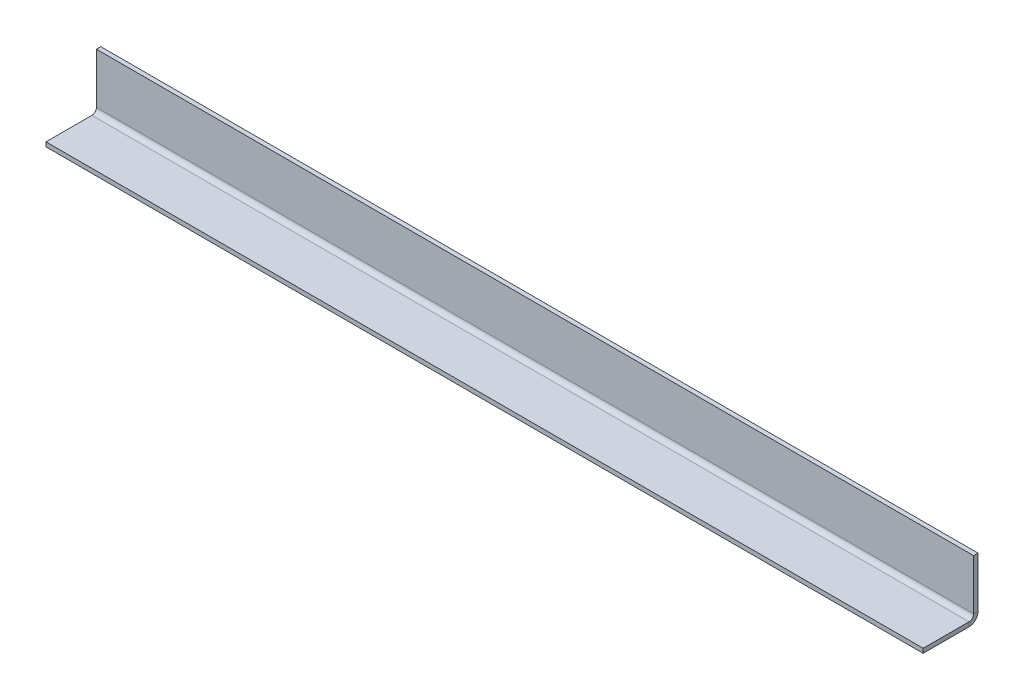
ISO-10303-21;
HEADER;
FILE_DESCRIPTION(('STEP AP214'),'2;1');
FILE_NAME('part.step','',(''),(''),'','','');
FILE_SCHEMA(('AUTOMOTIVE_DESIGN { 1 0 10303 214 1 1 1 1 }'));
ENDSEC;
DATA;
#1=APPLICATION_CONTEXT('core data for automotive mechanical design processes');
#2=APPLICATION_PROTOCOL_DEFINITION('international standard','automotive_design',2000,#1);
#3=PRODUCT_CONTEXT('',#1,'mechanical');
#4=PRODUCT('Part','Part','',(#3));
#5=PRODUCT_RELATED_PRODUCT_CATEGORY('part','',(#4));
#6=PRODUCT_DEFINITION_FORMATION('','',#4);
#7=PRODUCT_DEFINITION_CONTEXT('part definition',#1,'design');
#8=PRODUCT_DEFINITION('design','',#6,#7);
#9=PRODUCT_DEFINITION_SHAPE('','',#8);
#10=(LENGTH_UNIT() NAMED_UNIT(*) SI_UNIT(.MILLI.,.METRE.));
#11=(NAMED_UNIT(*) PLANE_ANGLE_UNIT() SI_UNIT($,.RADIAN.));
#12=(NAMED_UNIT(*) SI_UNIT($,.STERADIAN.) SOLID_ANGLE_UNIT());
#13=UNCERTAINTY_MEASURE_WITH_UNIT(LENGTH_MEASURE(1.E-05),#10,'distance_accuracy_value','');
#14=(GEOMETRIC_REPRESENTATION_CONTEXT(3) GLOBAL_UNCERTAINTY_ASSIGNED_CONTEXT((#13)) GLOBAL_UNIT_ASSIGNED_CONTEXT((#10,
#11,#12)) REPRESENTATION_CONTEXT('',''));
#15=CARTESIAN_POINT('',(0.,0.,0.));
#16=DIRECTION('',(0.,0.,1.));
#17=DIRECTION('',(1.,0.,0.));
#18=AXIS2_PLACEMENT_3D('',#15,#16,#17);
#19=CARTESIAN_POINT('',(0.,6.223,0.));
#20=DIRECTION('',(-1.,0.,0.));
#21=DIRECTION('',(0.,0.,1.));
#22=AXIS2_PLACEMENT_3D('',#19,#20,#21);
#23=PLANE('',#22);
#24=DIRECTION('',(0.,0.,1.));
#25=VECTOR('',#24,1.);
#26=CARTESIAN_POINT('',(0.,6.223,0.));
#27=LINE('',#26,#25);
#28=CARTESIAN_POINT('',(0.,6.223,0.));
#29=VERTEX_POINT('',#28);
#30=CARTESIAN_POINT('',(0.,6.223,3.048));
#31=VERTEX_POINT('',#30);
#32=EDGE_CURVE('E11',#29,#31,#27,.T.);
#33=ORIENTED_EDGE('',*,*,#32,.F.);
#34=CARTESIAN_POINT('',(0.,6.223,6.223));
#35=DIRECTION('',(1.,0.,0.));
#36=DIRECTION('',(0.,0.,-1.));
#37=AXIS2_PLACEMENT_3D('',#34,#35,#36);
#38=CIRCLE('',#37,6.223);
#39=CARTESIAN_POINT('',(0.,0.,6.223));
#40=VERTEX_POINT('',#39);
#41=EDGE_CURVE('E186',#29,#40,#38,.F.);
#42=ORIENTED_EDGE('',*,*,#41,.T.);
#43=DIRECTION('',(0.,-1.,0.));
#44=VECTOR('',#43,1.);
#45=CARTESIAN_POINT('',(0.,3.048,6.223));
#46=LINE('',#45,#44);
#47=CARTESIAN_POINT('',(0.,3.048,6.223));
#48=VERTEX_POINT('',#47);
#49=EDGE_CURVE('E56',#48,#40,#46,.T.);
#50=ORIENTED_EDGE('',*,*,#49,.F.);
#51=CARTESIAN_POINT('',(0.,6.223,6.223));
#52=DIRECTION('',(1.,0.,0.));
#53=DIRECTION('',(0.,0.,-1.));
#54=AXIS2_PLACEMENT_3D('',#51,#52,#53);
#55=CIRCLE('',#54,3.175);
#56=EDGE_CURVE('E201',#31,#48,#55,.F.);
#57=ORIENTED_EDGE('',*,*,#56,.F.);
#58=EDGE_LOOP('',(#33,#42,#50,#57));
#59=FACE_BOUND('',#58,.T.);
#60=ADVANCED_FACE('F48',(#59),#23,.T.);
#61=CARTESIAN_POINT('',(0.,3.048,6.223));
#62=DIRECTION('',(-1.,0.,0.));
#63=DIRECTION('',(0.,0.,1.));
#64=AXIS2_PLACEMENT_3D('',#61,#62,#63);
#65=PLANE('',#64);
#66=DIRECTION('',(0.,-1.,0.));
#67=VECTOR('',#66,1.);
#68=CARTESIAN_POINT('',(0.,0.,0.));
#69=LINE('',#68,#67);
#70=CARTESIAN_POINT('',(0.,41.275,0.));
#71=VERTEX_POINT('',#70);
#72=EDGE_CURVE('E189',#71,#29,#69,.T.);
#73=ORIENTED_EDGE('',*,*,#72,.T.);
#74=ORIENTED_EDGE('',*,*,#32,.T.);
#75=DIRECTION('',(0.,1.,0.));
#76=VECTOR('',#75,1.);
#77=CARTESIAN_POINT('',(0.,0.,3.048));
#78=LINE('',#77,#76);
#79=CARTESIAN_POINT('',(0.,41.275,3.048));
#80=VERTEX_POINT('',#79);
#81=EDGE_CURVE('E197',#80,#31,#78,.F.);
#82=ORIENTED_EDGE('',*,*,#81,.F.);
#83=DIRECTION('',(0.,0.,-1.));
#84=VECTOR('',#83,1.);
#85=CARTESIAN_POINT('',(0.,41.275,3.048));
#86=LINE('',#85,#84);
#87=EDGE_CURVE('E193',#80,#71,#86,.T.);
#88=ORIENTED_EDGE('',*,*,#87,.T.);
#89=EDGE_LOOP('',(#73,#74,#82,#88));
#90=FACE_BOUND('',#89,.T.);
#91=ADVANCED_FACE('F228',(#90),#65,.T.);
#92=CARTESIAN_POINT('',(665.771484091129,3.048,0.));
#93=DIRECTION('',(0.,-1.,0.));
#94=DIRECTION('',(0.,0.,-1.));
#95=AXIS2_PLACEMENT_3D('',#92,#93,#94);
#96=PLANE('',#95);
#97=DIRECTION('',(0.,0.,-1.));
#98=VECTOR('',#97,1.);
#99=CARTESIAN_POINT('',(609.6,3.048,0.));
#100=LINE('',#99,#98);
#101=CARTESIAN_POINT('',(609.6,3.048,6.223));
#102=VERTEX_POINT('',#101);
#103=CARTESIAN_POINT('',(609.6,3.04799999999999,38.1));
#104=VERTEX_POINT('',#103);
#105=EDGE_CURVE('E123',#102,#104,#100,.F.);
#106=ORIENTED_EDGE('',*,*,#105,.F.);
#107=DIRECTION('',(-1.,0.,0.));
#108=VECTOR('',#107,1.);
#109=CARTESIAN_POINT('',(665.771484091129,3.048,6.223));
#110=LINE('',#109,#108);
#111=EDGE_CURVE('E205',#102,#48,#110,.T.);
#112=ORIENTED_EDGE('',*,*,#111,.T.);
#113=DIRECTION('',(0.,0.,1.));
#114=VECTOR('',#113,1.);
#115=CARTESIAN_POINT('',(0.,3.048,0.));
#116=LINE('',#115,#114);
#117=CARTESIAN_POINT('',(0.,3.04799999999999,38.1));
#118=VERTEX_POINT('',#117);
#119=EDGE_CURVE('E168',#48,#118,#116,.T.);
#120=ORIENTED_EDGE('',*,*,#119,.T.);
#121=DIRECTION('',(-1.,0.,0.));
#122=VECTOR('',#121,1.);
#123=CARTESIAN_POINT('',(665.771484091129,3.04799999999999,38.1));
#124=LINE('',#123,#122);
#125=EDGE_CURVE('E154',#104,#118,#124,.T.);
#126=ORIENTED_EDGE('',*,*,#125,.F.);
#127=EDGE_LOOP('',(#106,#112,#120,#126));
#128=FACE_BOUND('',#127,.T.);
#129=ADVANCED_FACE('F270',(#128),#96,.F.);
#130=CARTESIAN_POINT('',(665.771484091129,0.,38.1));
#131=DIRECTION('',(0.,0.,1.));
#132=DIRECTION('',(1.,0.,0.));
#133=AXIS2_PLACEMENT_3D('',#130,#131,#132);
#134=PLANE('',#133);
#135=DIRECTION('',(-1.,0.,0.));
#136=VECTOR('',#135,1.);
#137=CARTESIAN_POINT('',(665.771484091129,0.,38.1));
#138=LINE('',#137,#136);
#139=CARTESIAN_POINT('',(609.6,0.,38.1));
#140=VERTEX_POINT('',#139);
#141=CARTESIAN_POINT('',(0.,0.,38.1));
#142=VERTEX_POINT('',#141);
#143=EDGE_CURVE('E149',#140,#142,#138,.T.);
#144=ORIENTED_EDGE('',*,*,#143,.F.);
#145=DIRECTION('',(0.,-1.,0.));
#146=VECTOR('',#145,1.);
#147=CARTESIAN_POINT('',(609.6,0.,38.1));
#148=LINE('',#147,#146);
#149=EDGE_CURVE('E122',#140,#104,#148,.F.);
#150=ORIENTED_EDGE('',*,*,#149,.T.);
#151=ORIENTED_EDGE('',*,*,#125,.T.);
#152=DIRECTION('',(0.,1.,0.));
#153=VECTOR('',#152,1.);
#154=CARTESIAN_POINT('',(0.,0.,38.1));
#155=LINE('',#154,#153);
#156=EDGE_CURVE('E170',#142,#118,#155,.T.);
#157=ORIENTED_EDGE('',*,*,#156,.F.);
#158=EDGE_LOOP('',(#144,#150,#151,#157));
#159=FACE_BOUND('',#158,.T.);
#160=ADVANCED_FACE('F274',(#159),#134,.T.);
#161=CARTESIAN_POINT('',(665.771484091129,0.,0.));
#162=DIRECTION('',(0.,-1.,0.));
#163=DIRECTION('',(0.,0.,-1.));
#164=AXIS2_PLACEMENT_3D('',#161,#162,#163);
#165=PLANE('',#164);
#166=DIRECTION('',(-1.,0.,0.));
#167=VECTOR('',#166,1.);
#168=CARTESIAN_POINT('',(665.771484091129,0.,6.223));
#169=LINE('',#168,#167);
#170=CARTESIAN_POINT('',(609.6,0.,6.223));
#171=VERTEX_POINT('',#170);
#172=EDGE_CURVE('E139',#171,#40,#169,.T.);
#173=ORIENTED_EDGE('',*,*,#172,.F.);
#174=DIRECTION('',(0.,0.,1.));
#175=VECTOR('',#174,1.);
#176=CARTESIAN_POINT('',(609.6,0.,0.));
#177=LINE('',#176,#175);
#178=EDGE_CURVE('E126',#171,#140,#177,.T.);
#179=ORIENTED_EDGE('',*,*,#178,.T.);
#180=ORIENTED_EDGE('',*,*,#143,.T.);
#181=DIRECTION('',(0.,0.,1.));
#182=VECTOR('',#181,1.);
#183=CARTESIAN_POINT('',(0.,0.,0.));
#184=LINE('',#183,#182);
#185=EDGE_CURVE('E147',#40,#142,#184,.T.);
#186=ORIENTED_EDGE('',*,*,#185,.F.);
#187=EDGE_LOOP('',(#173,#179,#180,#186));
#188=FACE_BOUND('',#187,.T.);
#189=ADVANCED_FACE('F145',(#188),#165,.T.);
#190=CARTESIAN_POINT('',(665.771484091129,6.223,6.223));
#191=DIRECTION('',(-1.,0.,0.));
#192=DIRECTION('',(0.,0.,1.));
#193=AXIS2_PLACEMENT_3D('',#190,#191,#192);
#194=CYLINDRICAL_SURFACE('',#193,6.223);
#195=DIRECTION('',(-1.,0.,0.));
#196=VECTOR('',#195,1.);
#197=CARTESIAN_POINT('',(665.771484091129,6.223,0.));
#198=LINE('',#197,#196);
#199=CARTESIAN_POINT('',(609.6,6.223,0.));
#200=VERTEX_POINT('',#199);
#201=EDGE_CURVE('E142',#200,#29,#198,.T.);
#202=ORIENTED_EDGE('',*,*,#201,.F.);
#203=CARTESIAN_POINT('',(609.6,6.223,6.223));
#204=DIRECTION('',(-1.,0.,0.));
#205=DIRECTION('',(0.,0.,1.));
#206=AXIS2_PLACEMENT_3D('',#203,#204,#205);
#207=CIRCLE('',#206,6.223);
#208=EDGE_CURVE('E116',#171,#200,#207,.F.);
#209=ORIENTED_EDGE('',*,*,#208,.F.);
#210=ORIENTED_EDGE('',*,*,#172,.T.);
#211=ORIENTED_EDGE('',*,*,#41,.F.);
#212=EDGE_LOOP('',(#202,#209,#210,#211));
#213=FACE_BOUND('',#212,.T.);
#214=ADVANCED_FACE('F137',(#213),#194,.T.);
#215=CARTESIAN_POINT('',(665.771484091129,0.,0.));
#216=DIRECTION('',(0.,0.,-1.));
#217=DIRECTION('',(-1.,0.,0.));
#218=AXIS2_PLACEMENT_3D('',#215,#216,#217);
#219=PLANE('',#218);
#220=DIRECTION('',(-1.,0.,0.));
#221=VECTOR('',#220,1.);
#222=CARTESIAN_POINT('',(665.771484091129,41.275,0.));
#223=LINE('',#222,#221);
#224=CARTESIAN_POINT('',(609.6,41.275,0.));
#225=VERTEX_POINT('',#224);
#226=EDGE_CURVE('E156',#225,#71,#223,.T.);
#227=ORIENTED_EDGE('',*,*,#226,.F.);
#228=DIRECTION('',(0.,1.,0.));
#229=VECTOR('',#228,1.);
#230=CARTESIAN_POINT('',(609.6,0.,0.));
#231=LINE('',#230,#229);
#232=EDGE_CURVE('E243',#225,#200,#231,.F.);
#233=ORIENTED_EDGE('',*,*,#232,.T.);
#234=ORIENTED_EDGE('',*,*,#201,.T.);
#235=ORIENTED_EDGE('',*,*,#72,.F.);
#236=EDGE_LOOP('',(#227,#233,#234,#235));
#237=FACE_BOUND('',#236,.T.);
#238=ADVANCED_FACE('F225',(#237),#219,.T.);
#239=CARTESIAN_POINT('',(665.771484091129,41.275,3.048));
#240=DIRECTION('',(0.,1.,0.));
#241=DIRECTION('',(0.,0.,1.));
#242=AXIS2_PLACEMENT_3D('',#239,#240,#241);
#243=PLANE('',#242);
#244=DIRECTION('',(-1.,0.,0.));
#245=VECTOR('',#244,1.);
#246=CARTESIAN_POINT('',(665.771484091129,41.275,3.048));
#247=LINE('',#246,#245);
#248=CARTESIAN_POINT('',(609.6,41.275,3.048));
#249=VERTEX_POINT('',#248);
#250=EDGE_CURVE('E212',#249,#80,#247,.T.);
#251=ORIENTED_EDGE('',*,*,#250,.F.);
#252=DIRECTION('',(0.,0.,1.));
#253=VECTOR('',#252,1.);
#254=CARTESIAN_POINT('',(609.6,41.275,3.048));
#255=LINE('',#254,#253);
#256=EDGE_CURVE('E180',#249,#225,#255,.F.);
#257=ORIENTED_EDGE('',*,*,#256,.T.);
#258=ORIENTED_EDGE('',*,*,#226,.T.);
#259=ORIENTED_EDGE('',*,*,#87,.F.);
#260=EDGE_LOOP('',(#251,#257,#258,#259));
#261=FACE_BOUND('',#260,.T.);
#262=ADVANCED_FACE('F222',(#261),#243,.T.);
#263=CARTESIAN_POINT('',(665.771484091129,0.,3.048));
#264=DIRECTION('',(0.,0.,-1.));
#265=DIRECTION('',(-1.,0.,0.));
#266=AXIS2_PLACEMENT_3D('',#263,#264,#265);
#267=PLANE('',#266);
#268=DIRECTION('',(0.,-1.,0.));
#269=VECTOR('',#268,1.);
#270=CARTESIAN_POINT('',(609.6,0.,3.048));
#271=LINE('',#270,#269);
#272=CARTESIAN_POINT('',(609.6,6.223,3.048));
#273=VERTEX_POINT('',#272);
#274=EDGE_CURVE('E63',#249,#273,#271,.T.);
#275=ORIENTED_EDGE('',*,*,#274,.F.);
#276=ORIENTED_EDGE('',*,*,#250,.T.);
#277=ORIENTED_EDGE('',*,*,#81,.T.);
#278=DIRECTION('',(-1.,0.,0.));
#279=VECTOR('',#278,1.);
#280=CARTESIAN_POINT('',(665.771484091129,6.223,3.048));
#281=LINE('',#280,#279);
#282=EDGE_CURVE('E208',#273,#31,#281,.T.);
#283=ORIENTED_EDGE('',*,*,#282,.F.);
#284=EDGE_LOOP('',(#275,#276,#277,#283));
#285=FACE_BOUND('',#284,.T.);
#286=ADVANCED_FACE('F231',(#285),#267,.F.);
#287=CARTESIAN_POINT('',(665.771484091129,6.223,6.223));
#288=DIRECTION('',(-1.,0.,0.));
#289=DIRECTION('',(0.,0.,1.));
#290=AXIS2_PLACEMENT_3D('',#287,#288,#289);
#291=CYLINDRICAL_SURFACE('',#290,3.175);
#292=CARTESIAN_POINT('',(609.6,6.223,6.223));
#293=DIRECTION('',(1.,0.,0.));
#294=DIRECTION('',(0.,0.,-1.));
#295=AXIS2_PLACEMENT_3D('',#292,#293,#294);
#296=CIRCLE('',#295,3.175);
#297=EDGE_CURVE('E118',#273,#102,#296,.F.);
#298=ORIENTED_EDGE('',*,*,#297,.F.);
#299=ORIENTED_EDGE('',*,*,#282,.T.);
#300=ORIENTED_EDGE('',*,*,#56,.T.);
#301=ORIENTED_EDGE('',*,*,#111,.F.);
#302=EDGE_LOOP('',(#298,#299,#300,#301));
#303=FACE_BOUND('',#302,.T.);
#304=ADVANCED_FACE('F234',(#303),#291,.F.);
#305=CARTESIAN_POINT('',(0.,6.223,6.223));
#306=DIRECTION('',(1.,0.,0.));
#307=DIRECTION('',(0.,0.,-1.));
#308=AXIS2_PLACEMENT_3D('',#305,#306,#307);
#309=PLANE('',#308);
#310=ORIENTED_EDGE('',*,*,#119,.F.);
#311=ORIENTED_EDGE('',*,*,#49,.T.);
#312=ORIENTED_EDGE('',*,*,#185,.T.);
#313=ORIENTED_EDGE('',*,*,#156,.T.);
#314=EDGE_LOOP('',(#310,#311,#312,#313));
#315=FACE_BOUND('',#314,.T.);
#316=ADVANCED_FACE('F165',(#315),#309,.F.);
#317=CARTESIAN_POINT('',(609.6,0.,3.048));
#318=DIRECTION('',(1.,0.,0.));
#319=DIRECTION('',(0.,-1.,0.));
#320=AXIS2_PLACEMENT_3D('',#317,#318,#319);
#321=PLANE('',#320);
#322=ORIENTED_EDGE('',*,*,#274,.T.);
#323=DIRECTION('',(0.,0.,1.));
#324=VECTOR('',#323,1.);
#325=CARTESIAN_POINT('',(609.6,6.223,3.048));
#326=LINE('',#325,#324);
#327=EDGE_CURVE('E174',#273,#200,#326,.F.);
#328=ORIENTED_EDGE('',*,*,#327,.T.);
#329=ORIENTED_EDGE('',*,*,#232,.F.);
#330=ORIENTED_EDGE('',*,*,#256,.F.);
#331=EDGE_LOOP('',(#322,#328,#329,#330));
#332=FACE_BOUND('',#331,.T.);
#333=ADVANCED_FACE('F257',(#332),#321,.T.);
#334=CARTESIAN_POINT('',(609.6,0.,0.));
#335=DIRECTION('',(1.,0.,0.));
#336=DIRECTION('',(0.,0.,1.));
#337=AXIS2_PLACEMENT_3D('',#334,#335,#336);
#338=PLANE('',#337);
#339=ORIENTED_EDGE('',*,*,#149,.F.);
#340=ORIENTED_EDGE('',*,*,#178,.F.);
#341=DIRECTION('',(0.,-1.,0.));
#342=VECTOR('',#341,1.);
#343=CARTESIAN_POINT('',(609.6,0.,6.223));
#344=LINE('',#343,#342);
#345=EDGE_CURVE('E112',#171,#102,#344,.F.);
#346=ORIENTED_EDGE('',*,*,#345,.T.);
#347=ORIENTED_EDGE('',*,*,#105,.T.);
#348=EDGE_LOOP('',(#339,#340,#346,#347));
#349=FACE_BOUND('',#348,.T.);
#350=ADVANCED_FACE('F127',(#349),#338,.T.);
#351=CARTESIAN_POINT('',(609.6,6.223,6.223));
#352=DIRECTION('',(-1.,0.,0.));
#353=DIRECTION('',(0.,0.,1.));
#354=AXIS2_PLACEMENT_3D('',#351,#352,#353);
#355=PLANE('',#354);
#356=ORIENTED_EDGE('',*,*,#208,.T.);
#357=ORIENTED_EDGE('',*,*,#327,.F.);
#358=ORIENTED_EDGE('',*,*,#297,.T.);
#359=ORIENTED_EDGE('',*,*,#345,.F.);
#360=EDGE_LOOP('',(#356,#357,#358,#359));
#361=FACE_BOUND('',#360,.T.);
#362=ADVANCED_FACE('F114',(#361),#355,.F.);
#363=CLOSED_SHELL('',(#60,#91,#129,#160,#189,#214,#238,#262,#286,#304,#316,#333,#350,#362));
#364=MANIFOLD_SOLID_BREP('B2',#363);
#365=ADVANCED_BREP_SHAPE_REPRESENTATION('',(#18,#364),#14);
#366=SHAPE_DEFINITION_REPRESENTATION(#9,#365);
ENDSEC;
END-ISO-10303-21;
